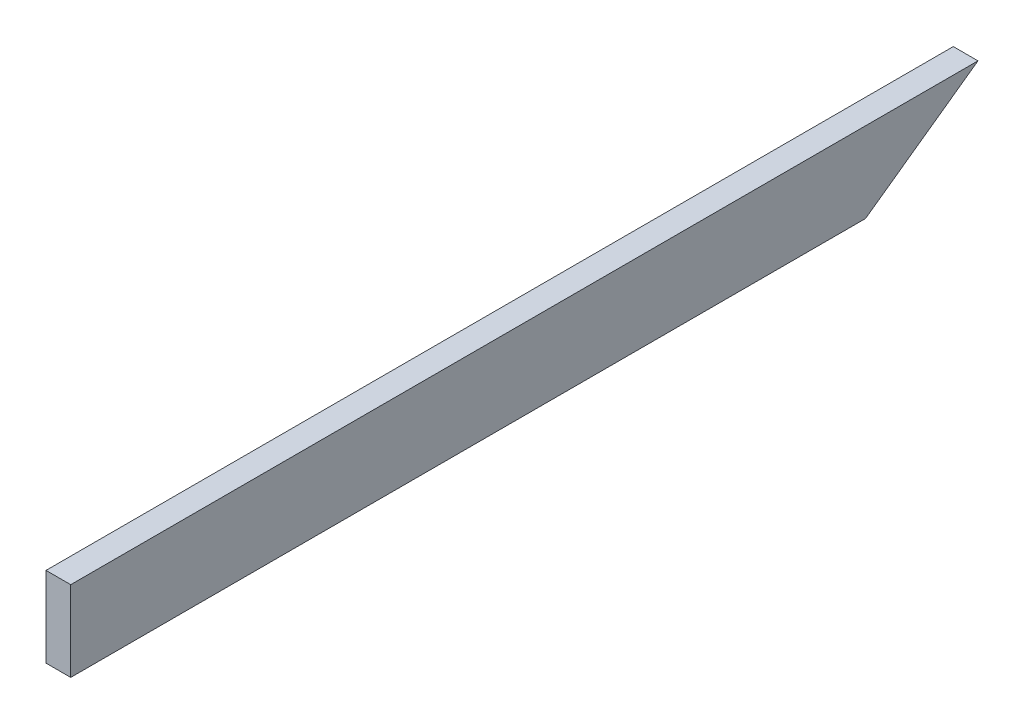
ISO-10303-21;
HEADER;
FILE_DESCRIPTION(('STEP AP214'),'2;1');
FILE_NAME('part.step','',(''),(''),'','','');
FILE_SCHEMA(('AUTOMOTIVE_DESIGN { 1 0 10303 214 1 1 1 1 }'));
ENDSEC;
DATA;
#1=APPLICATION_CONTEXT('core data for automotive mechanical design processes');
#2=APPLICATION_PROTOCOL_DEFINITION('international standard','automotive_design',2000,#1);
#3=PRODUCT_CONTEXT('',#1,'mechanical');
#4=PRODUCT('Part','Part','',(#3));
#5=PRODUCT_RELATED_PRODUCT_CATEGORY('part','',(#4));
#6=PRODUCT_DEFINITION_FORMATION('','',#4);
#7=PRODUCT_DEFINITION_CONTEXT('part definition',#1,'design');
#8=PRODUCT_DEFINITION('design','',#6,#7);
#9=PRODUCT_DEFINITION_SHAPE('','',#8);
#10=(LENGTH_UNIT() NAMED_UNIT(*) SI_UNIT(.MILLI.,.METRE.));
#11=(NAMED_UNIT(*) PLANE_ANGLE_UNIT() SI_UNIT($,.RADIAN.));
#12=(NAMED_UNIT(*) SI_UNIT($,.STERADIAN.) SOLID_ANGLE_UNIT());
#13=UNCERTAINTY_MEASURE_WITH_UNIT(LENGTH_MEASURE(1.E-05),#10,'distance_accuracy_value','');
#14=(GEOMETRIC_REPRESENTATION_CONTEXT(3) GLOBAL_UNCERTAINTY_ASSIGNED_CONTEXT((#13)) GLOBAL_UNIT_ASSIGNED_CONTEXT((#10,
#11,#12)) REPRESENTATION_CONTEXT('',''));
#15=CARTESIAN_POINT('',(0.,0.,0.));
#16=DIRECTION('',(0.,0.,1.));
#17=DIRECTION('',(1.,0.,0.));
#18=AXIS2_PLACEMENT_3D('',#15,#16,#17);
#19=CARTESIAN_POINT('',(-2.,6.5,150.));
#20=DIRECTION('',(1.,0.,0.));
#21=DIRECTION('',(0.,0.,-1.));
#22=AXIS2_PLACEMENT_3D('',#19,#20,#21);
#23=PLANE('',#22);
#24=DIRECTION('',(0.,0.,-1.));
#25=VECTOR('',#24,1.);
#26=CARTESIAN_POINT('',(-2.,6.5,150.));
#27=LINE('',#26,#25);
#28=CARTESIAN_POINT('',(-2.,6.5,150.));
#29=VERTEX_POINT('',#28);
#30=CARTESIAN_POINT('',(-2.,6.5,3.18897153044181));
#31=VERTEX_POINT('',#30);
#32=EDGE_CURVE('E78',#29,#31,#27,.T.);
#33=ORIENTED_EDGE('',*,*,#32,.T.);
#34=DIRECTION('',(0.,0.581208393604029,-0.813754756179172));
#35=VECTOR('',#34,1.);
#36=CARTESIAN_POINT('',(-2.,-6.5,21.3903807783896));
#37=LINE('',#36,#35);
#38=CARTESIAN_POINT('',(-2.,-6.5,21.3903807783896));
#39=VERTEX_POINT('',#38);
#40=EDGE_CURVE('E40',#39,#31,#37,.T.);
#41=ORIENTED_EDGE('',*,*,#40,.F.);
#42=DIRECTION('',(0.,0.,-1.));
#43=VECTOR('',#42,1.);
#44=CARTESIAN_POINT('',(-2.,-6.5,150.));
#45=LINE('',#44,#43);
#46=CARTESIAN_POINT('',(-2.,-6.5,150.));
#47=VERTEX_POINT('',#46);
#48=EDGE_CURVE('E11',#47,#39,#45,.T.);
#49=ORIENTED_EDGE('',*,*,#48,.F.);
#50=DIRECTION('',(0.,-1.,0.));
#51=VECTOR('',#50,1.);
#52=CARTESIAN_POINT('',(-2.,6.5,150.));
#53=LINE('',#52,#51);
#54=EDGE_CURVE('E84',#29,#47,#53,.T.);
#55=ORIENTED_EDGE('',*,*,#54,.F.);
#56=EDGE_LOOP('',(#33,#41,#49,#55));
#57=FACE_BOUND('',#56,.T.);
#58=ADVANCED_FACE('F26',(#57),#23,.F.);
#59=CARTESIAN_POINT('',(-2.,-6.5,150.));
#60=DIRECTION('',(0.,1.,0.));
#61=DIRECTION('',(0.,0.,1.));
#62=AXIS2_PLACEMENT_3D('',#59,#60,#61);
#63=PLANE('',#62);
#64=ORIENTED_EDGE('',*,*,#48,.T.);
#65=DIRECTION('',(-1.,0.,0.));
#66=VECTOR('',#65,1.);
#67=CARTESIAN_POINT('',(8.,-6.5,21.3903807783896));
#68=LINE('',#67,#66);
#69=CARTESIAN_POINT('',(2.,-6.5,21.3903807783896));
#70=VERTEX_POINT('',#69);
#71=EDGE_CURVE('E65',#70,#39,#68,.T.);
#72=ORIENTED_EDGE('',*,*,#71,.F.);
#73=DIRECTION('',(0.,0.,-1.));
#74=VECTOR('',#73,1.);
#75=CARTESIAN_POINT('',(2.,-6.5,150.));
#76=LINE('',#75,#74);
#77=CARTESIAN_POINT('',(2.,-6.5,150.));
#78=VERTEX_POINT('',#77);
#79=EDGE_CURVE('E33',#78,#70,#76,.T.);
#80=ORIENTED_EDGE('',*,*,#79,.F.);
#81=DIRECTION('',(1.,0.,0.));
#82=VECTOR('',#81,1.);
#83=CARTESIAN_POINT('',(-2.,-6.5,150.));
#84=LINE('',#83,#82);
#85=EDGE_CURVE('E81',#47,#78,#84,.T.);
#86=ORIENTED_EDGE('',*,*,#85,.F.);
#87=EDGE_LOOP('',(#64,#72,#80,#86));
#88=FACE_BOUND('',#87,.T.);
#89=ADVANCED_FACE('F80',(#88),#63,.F.);
#90=CARTESIAN_POINT('',(2.,6.5,150.));
#91=DIRECTION('',(-1.,0.,0.));
#92=DIRECTION('',(0.,0.,1.));
#93=AXIS2_PLACEMENT_3D('',#90,#91,#92);
#94=PLANE('',#93);
#95=ORIENTED_EDGE('',*,*,#79,.T.);
#96=DIRECTION('',(0.,0.581208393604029,-0.813754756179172));
#97=VECTOR('',#96,1.);
#98=CARTESIAN_POINT('',(2.,-62.9359047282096,100.406765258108));
#99=LINE('',#98,#97);
#100=CARTESIAN_POINT('',(2.,6.5,3.18897153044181));
#101=VERTEX_POINT('',#100);
#102=EDGE_CURVE('E68',#70,#101,#99,.T.);
#103=ORIENTED_EDGE('',*,*,#102,.T.);
#104=DIRECTION('',(0.,0.,-1.));
#105=VECTOR('',#104,1.);
#106=CARTESIAN_POINT('',(2.,6.5,150.));
#107=LINE('',#106,#105);
#108=CARTESIAN_POINT('',(2.,6.5,150.));
#109=VERTEX_POINT('',#108);
#110=EDGE_CURVE('E93',#109,#101,#107,.T.);
#111=ORIENTED_EDGE('',*,*,#110,.F.);
#112=DIRECTION('',(0.,1.,0.));
#113=VECTOR('',#112,1.);
#114=CARTESIAN_POINT('',(2.,6.5,150.));
#115=LINE('',#114,#113);
#116=EDGE_CURVE('E83',#78,#109,#115,.T.);
#117=ORIENTED_EDGE('',*,*,#116,.F.);
#118=EDGE_LOOP('',(#95,#103,#111,#117));
#119=FACE_BOUND('',#118,.T.);
#120=ADVANCED_FACE('F96',(#119),#94,.F.);
#121=CARTESIAN_POINT('',(-2.,6.5,150.));
#122=DIRECTION('',(0.,-1.,0.));
#123=DIRECTION('',(0.,0.,-1.));
#124=AXIS2_PLACEMENT_3D('',#121,#122,#123);
#125=PLANE('',#124);
#126=ORIENTED_EDGE('',*,*,#110,.T.);
#127=DIRECTION('',(-1.,0.,0.));
#128=VECTOR('',#127,1.);
#129=CARTESIAN_POINT('',(8.,6.5,3.18897153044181));
#130=LINE('',#129,#128);
#131=EDGE_CURVE('E72',#101,#31,#130,.T.);
#132=ORIENTED_EDGE('',*,*,#131,.T.);
#133=ORIENTED_EDGE('',*,*,#32,.F.);
#134=DIRECTION('',(-1.,0.,0.));
#135=VECTOR('',#134,1.);
#136=CARTESIAN_POINT('',(-2.,6.5,150.));
#137=LINE('',#136,#135);
#138=EDGE_CURVE('E48',#109,#29,#137,.T.);
#139=ORIENTED_EDGE('',*,*,#138,.F.);
#140=EDGE_LOOP('',(#126,#132,#133,#139));
#141=FACE_BOUND('',#140,.T.);
#142=ADVANCED_FACE('F99',(#141),#125,.F.);
#143=CARTESIAN_POINT('',(-2.,-6.5,150.));
#144=DIRECTION('',(0.,0.,1.));
#145=DIRECTION('',(1.,0.,0.));
#146=AXIS2_PLACEMENT_3D('',#143,#144,#145);
#147=PLANE('',#146);
#148=ORIENTED_EDGE('',*,*,#54,.T.);
#149=ORIENTED_EDGE('',*,*,#85,.T.);
#150=ORIENTED_EDGE('',*,*,#116,.T.);
#151=ORIENTED_EDGE('',*,*,#138,.T.);
#152=EDGE_LOOP('',(#148,#149,#150,#151));
#153=FACE_BOUND('',#152,.T.);
#154=ADVANCED_FACE('F86',(#153),#147,.T.);
#155=CARTESIAN_POINT('',(8.,-6.5,21.3903807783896));
#156=DIRECTION('',(0.,0.813754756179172,0.581208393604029));
#157=DIRECTION('',(0.,-0.581208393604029,0.813754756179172));
#158=AXIS2_PLACEMENT_3D('',#155,#156,#157);
#159=PLANE('',#158);
#160=ORIENTED_EDGE('',*,*,#71,.T.);
#161=ORIENTED_EDGE('',*,*,#40,.T.);
#162=ORIENTED_EDGE('',*,*,#131,.F.);
#163=ORIENTED_EDGE('',*,*,#102,.F.);
#164=EDGE_LOOP('',(#160,#161,#162,#163));
#165=FACE_BOUND('',#164,.T.);
#166=ADVANCED_FACE('F66',(#165),#159,.F.);
#167=CLOSED_SHELL('',(#58,#89,#120,#142,#154,#166));
#168=MANIFOLD_SOLID_BREP('B2',#167);
#169=ADVANCED_BREP_SHAPE_REPRESENTATION('',(#18,#168),#14);
#170=SHAPE_DEFINITION_REPRESENTATION(#9,#169);
ENDSEC;
END-ISO-10303-21;
